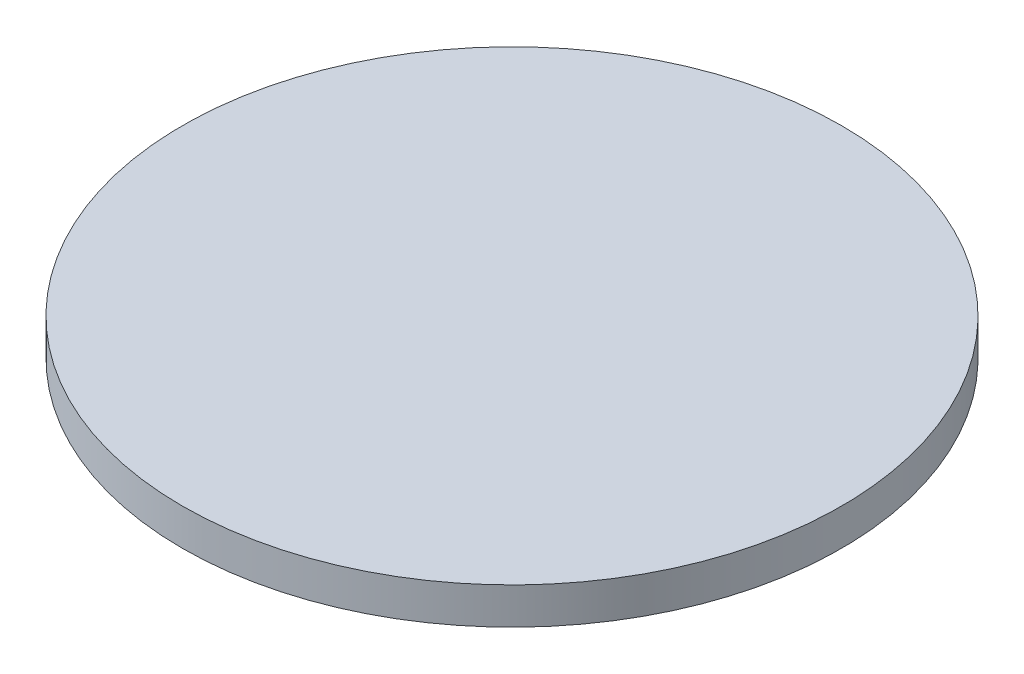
from build123d import *

# Parameters (mm, degrees)
SKETCH_1_R      = 45
EXTRUDE_1_DEPTH = 5


with BuildPart() as part:
    # Sketch 1 → Extrude 1 (new body)
    with BuildSketch(Plane(origin=(0, 0, 0), x_dir=(1, 0, 0), z_dir=(0, 1, 0))):
        with Locations(Location((0, 0, 0), (0, 0, 270))):
            Circle(SKETCH_1_R)
    extrude(amount=EXTRUDE_1_DEPTH)


solid = part.part
